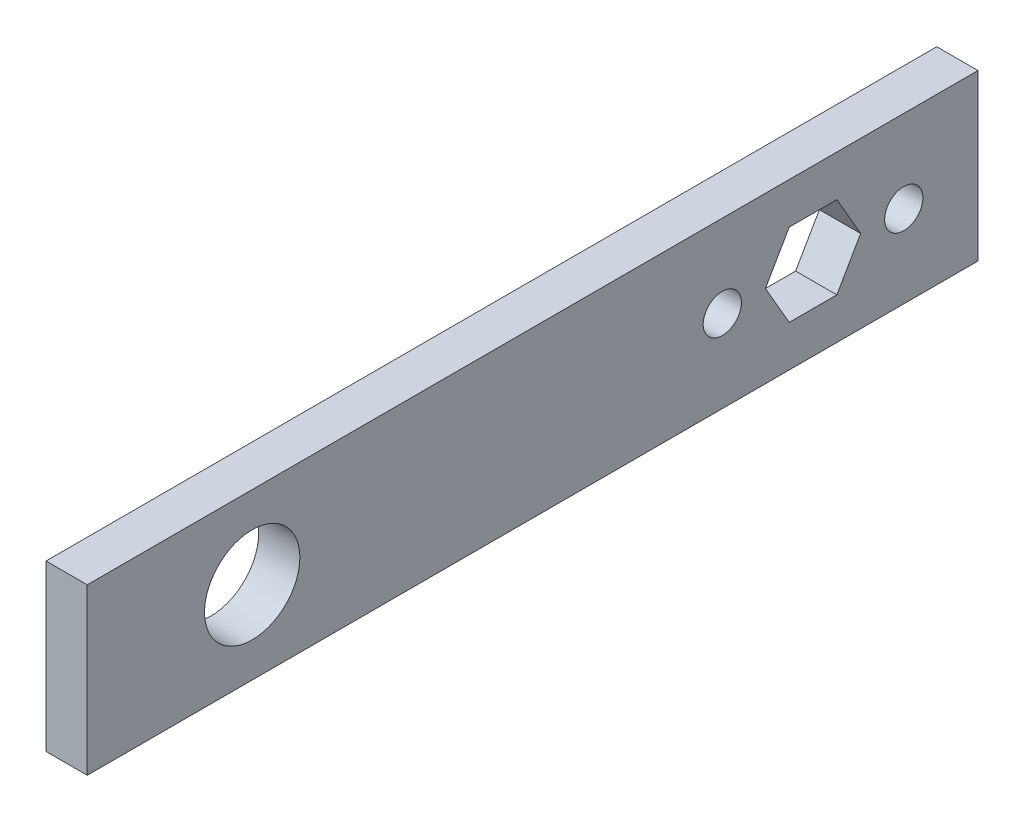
ISO-10303-21;
HEADER;
FILE_DESCRIPTION(('STEP AP214'),'2;1');
FILE_NAME('part.step','',(''),(''),'','','');
FILE_SCHEMA(('AUTOMOTIVE_DESIGN { 1 0 10303 214 1 1 1 1 }'));
ENDSEC;
DATA;
#1=APPLICATION_CONTEXT('core data for automotive mechanical design processes');
#2=APPLICATION_PROTOCOL_DEFINITION('international standard','automotive_design',2000,#1);
#3=PRODUCT_CONTEXT('',#1,'mechanical');
#4=PRODUCT('Part','Part','',(#3));
#5=PRODUCT_RELATED_PRODUCT_CATEGORY('part','',(#4));
#6=PRODUCT_DEFINITION_FORMATION('','',#4);
#7=PRODUCT_DEFINITION_CONTEXT('part definition',#1,'design');
#8=PRODUCT_DEFINITION('design','',#6,#7);
#9=PRODUCT_DEFINITION_SHAPE('','',#8);
#10=(LENGTH_UNIT() NAMED_UNIT(*) SI_UNIT(.MILLI.,.METRE.));
#11=(NAMED_UNIT(*) PLANE_ANGLE_UNIT() SI_UNIT($,.RADIAN.));
#12=(NAMED_UNIT(*) SI_UNIT($,.STERADIAN.) SOLID_ANGLE_UNIT());
#13=UNCERTAINTY_MEASURE_WITH_UNIT(LENGTH_MEASURE(1.E-05),#10,'distance_accuracy_value','');
#14=(GEOMETRIC_REPRESENTATION_CONTEXT(3) GLOBAL_UNCERTAINTY_ASSIGNED_CONTEXT((#13)) GLOBAL_UNIT_ASSIGNED_CONTEXT((#10,
#11,#12)) REPRESENTATION_CONTEXT('',''));
#15=CARTESIAN_POINT('',(0.,0.,0.));
#16=DIRECTION('',(0.,0.,1.));
#17=DIRECTION('',(1.,0.,0.));
#18=AXIS2_PLACEMENT_3D('',#15,#16,#17);
#19=CARTESIAN_POINT('',(0.,0.,0.));
#20=DIRECTION('',(-1.,0.,0.));
#21=DIRECTION('',(0.,0.,1.));
#22=AXIS2_PLACEMENT_3D('',#19,#20,#21);
#23=PLANE('',#22);
#24=DIRECTION('',(0.,0.866025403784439,-0.499999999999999));
#25=VECTOR('',#24,1.);
#26=CARTESIAN_POINT('',(0.,3.175,-57.7130871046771));
#27=LINE('',#26,#25);
#28=CARTESIAN_POINT('',(0.,3.175,-57.7130871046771));
#29=VERTEX_POINT('',#28);
#30=CARTESIAN_POINT('',(0.,6.35,-59.5461742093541));
#31=VERTEX_POINT('',#30);
#32=EDGE_CURVE('E114',#29,#31,#27,.T.);
#33=ORIENTED_EDGE('',*,*,#32,.T.);
#34=DIRECTION('',(0.,0.866025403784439,0.5));
#35=VECTOR('',#34,1.);
#36=CARTESIAN_POINT('',(0.,6.35,-59.5461742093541));
#37=LINE('',#36,#35);
#38=CARTESIAN_POINT('',(0.,9.52500000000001,-57.713087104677));
#39=VERTEX_POINT('',#38);
#40=EDGE_CURVE('E123',#31,#39,#37,.T.);
#41=ORIENTED_EDGE('',*,*,#40,.T.);
#42=DIRECTION('',(0.,0.,1.));
#43=VECTOR('',#42,1.);
#44=CARTESIAN_POINT('',(0.,9.52500000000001,-57.7130871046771));
#45=LINE('',#44,#43);
#46=CARTESIAN_POINT('',(0.,9.52500000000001,-54.0469128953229));
#47=VERTEX_POINT('',#46);
#48=EDGE_CURVE('E50',#39,#47,#45,.T.);
#49=ORIENTED_EDGE('',*,*,#48,.T.);
#50=DIRECTION('',(0.,-0.866025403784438,0.500000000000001));
#51=VECTOR('',#50,1.);
#52=CARTESIAN_POINT('',(0.,9.52500000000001,-54.0469128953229));
#53=LINE('',#52,#51);
#54=CARTESIAN_POINT('',(0.,6.35,-52.2138257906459));
#55=VERTEX_POINT('',#54);
#56=EDGE_CURVE('E137',#47,#55,#53,.T.);
#57=ORIENTED_EDGE('',*,*,#56,.T.);
#58=DIRECTION('',(0.,-0.866025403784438,-0.500000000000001));
#59=VECTOR('',#58,1.);
#60=CARTESIAN_POINT('',(0.,6.35,-52.2138257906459));
#61=LINE('',#60,#59);
#62=CARTESIAN_POINT('',(0.,3.175,-54.0469128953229));
#63=VERTEX_POINT('',#62);
#64=EDGE_CURVE('E140',#55,#63,#61,.T.);
#65=ORIENTED_EDGE('',*,*,#64,.T.);
#66=DIRECTION('',(0.,0.,-1.));
#67=VECTOR('',#66,1.);
#68=CARTESIAN_POINT('',(0.,3.175,-54.0469128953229));
#69=LINE('',#68,#67);
#70=EDGE_CURVE('E120',#63,#29,#69,.T.);
#71=ORIENTED_EDGE('',*,*,#70,.T.);
#72=EDGE_LOOP('',(#33,#41,#49,#57,#65,#71));
#73=FACE_BOUND('',#72,.T.);
#74=CARTESIAN_POINT('',(0.,6.35,-48.895));
#75=DIRECTION('',(1.,0.,0.));
#76=DIRECTION('',(0.,0.,-1.));
#77=AXIS2_PLACEMENT_3D('',#74,#75,#76);
#78=CIRCLE('',#77,1.4732);
#79=CARTESIAN_POINT('',(0.,6.35,-50.3682));
#80=VERTEX_POINT('',#79);
#81=EDGE_CURVE('E166',#80,#80,#78,.T.);
#82=ORIENTED_EDGE('',*,*,#81,.T.);
#83=EDGE_LOOP('',(#82));
#84=FACE_BOUND('',#83,.T.);
#85=CARTESIAN_POINT('',(0.,6.35,-12.7));
#86=DIRECTION('',(1.,0.,0.));
#87=DIRECTION('',(0.,0.,-1.));
#88=AXIS2_PLACEMENT_3D('',#85,#86,#87);
#89=CIRCLE('',#88,3.6703);
#90=CARTESIAN_POINT('',(0.,6.35,-16.3703));
#91=VERTEX_POINT('',#90);
#92=EDGE_CURVE('E175',#91,#91,#89,.T.);
#93=ORIENTED_EDGE('',*,*,#92,.T.);
#94=EDGE_LOOP('',(#93));
#95=FACE_BOUND('',#94,.T.);
#96=DIRECTION('',(0.,-1.,0.));
#97=VECTOR('',#96,1.);
#98=CARTESIAN_POINT('',(0.,0.,0.));
#99=LINE('',#98,#97);
#100=CARTESIAN_POINT('',(0.,12.7,0.));
#101=VERTEX_POINT('',#100);
#102=CARTESIAN_POINT('',(0.,0.,0.));
#103=VERTEX_POINT('',#102);
#104=EDGE_CURVE('E179',#101,#103,#99,.T.);
#105=ORIENTED_EDGE('',*,*,#104,.F.);
#106=DIRECTION('',(0.,0.,1.));
#107=VECTOR('',#106,1.);
#108=CARTESIAN_POINT('',(0.,12.7,0.));
#109=LINE('',#108,#107);
#110=CARTESIAN_POINT('',(0.,12.7,-68.58));
#111=VERTEX_POINT('',#110);
#112=EDGE_CURVE('E186',#111,#101,#109,.T.);
#113=ORIENTED_EDGE('',*,*,#112,.F.);
#114=DIRECTION('',(0.,1.,0.));
#115=VECTOR('',#114,1.);
#116=CARTESIAN_POINT('',(0.,0.,-68.58));
#117=LINE('',#116,#115);
#118=CARTESIAN_POINT('',(0.,0.,-68.58));
#119=VERTEX_POINT('',#118);
#120=EDGE_CURVE('E197',#119,#111,#117,.T.);
#121=ORIENTED_EDGE('',*,*,#120,.F.);
#122=DIRECTION('',(0.,0.,-1.));
#123=VECTOR('',#122,1.);
#124=CARTESIAN_POINT('',(0.,0.,0.));
#125=LINE('',#124,#123);
#126=EDGE_CURVE('E195',#103,#119,#125,.T.);
#127=ORIENTED_EDGE('',*,*,#126,.F.);
#128=EDGE_LOOP('',(#105,#113,#121,#127));
#129=FACE_BOUND('',#128,.T.);
#130=CARTESIAN_POINT('',(0.,6.35,-62.865));
#131=DIRECTION('',(1.,0.,0.));
#132=DIRECTION('',(0.,0.,-1.));
#133=AXIS2_PLACEMENT_3D('',#130,#131,#132);
#134=CIRCLE('',#133,1.4732);
#135=CARTESIAN_POINT('',(0.,6.35,-64.3382));
#136=VERTEX_POINT('',#135);
#137=EDGE_CURVE('E172',#136,#136,#134,.T.);
#138=ORIENTED_EDGE('',*,*,#137,.T.);
#139=EDGE_LOOP('',(#138));
#140=FACE_BOUND('',#139,.T.);
#141=ADVANCED_FACE('F35',(#73,#84,#95,#129,#140),#23,.T.);
#142=CARTESIAN_POINT('',(3.175,0.,0.));
#143=DIRECTION('',(-1.,0.,0.));
#144=DIRECTION('',(0.,0.,1.));
#145=AXIS2_PLACEMENT_3D('',#142,#143,#144);
#146=PLANE('',#145);
#147=DIRECTION('',(0.,0.866025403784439,0.5));
#148=VECTOR('',#147,1.);
#149=CARTESIAN_POINT('',(3.175,6.35,-59.5461742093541));
#150=LINE('',#149,#148);
#151=CARTESIAN_POINT('',(3.175,6.35000000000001,-59.5461742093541));
#152=VERTEX_POINT('',#151);
#153=CARTESIAN_POINT('',(3.175,9.52500000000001,-57.7130871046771));
#154=VERTEX_POINT('',#153);
#155=EDGE_CURVE('E144',#152,#154,#150,.T.);
#156=ORIENTED_EDGE('',*,*,#155,.F.);
#157=DIRECTION('',(0.,0.866025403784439,-0.499999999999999));
#158=VECTOR('',#157,1.);
#159=CARTESIAN_POINT('',(3.175,3.175,-57.7130871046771));
#160=LINE('',#159,#158);
#161=CARTESIAN_POINT('',(3.175,3.175,-57.7130871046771));
#162=VERTEX_POINT('',#161);
#163=EDGE_CURVE('E58',#162,#152,#160,.T.);
#164=ORIENTED_EDGE('',*,*,#163,.F.);
#165=DIRECTION('',(0.,0.,-1.));
#166=VECTOR('',#165,1.);
#167=CARTESIAN_POINT('',(3.175,3.175,-54.0469128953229));
#168=LINE('',#167,#166);
#169=CARTESIAN_POINT('',(3.175,3.175,-54.0469128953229));
#170=VERTEX_POINT('',#169);
#171=EDGE_CURVE('E130',#170,#162,#168,.T.);
#172=ORIENTED_EDGE('',*,*,#171,.F.);
#173=DIRECTION('',(0.,-0.866025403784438,-0.500000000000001));
#174=VECTOR('',#173,1.);
#175=CARTESIAN_POINT('',(3.175,6.35,-52.2138257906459));
#176=LINE('',#175,#174);
#177=CARTESIAN_POINT('',(3.175,6.35,-52.2138257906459));
#178=VERTEX_POINT('',#177);
#179=EDGE_CURVE('E133',#178,#170,#176,.T.);
#180=ORIENTED_EDGE('',*,*,#179,.F.);
#181=DIRECTION('',(0.,-0.866025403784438,0.500000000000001));
#182=VECTOR('',#181,1.);
#183=CARTESIAN_POINT('',(3.175,9.52500000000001,-54.0469128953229));
#184=LINE('',#183,#182);
#185=CARTESIAN_POINT('',(3.175,9.52500000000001,-54.0469128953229));
#186=VERTEX_POINT('',#185);
#187=EDGE_CURVE('E149',#186,#178,#184,.T.);
#188=ORIENTED_EDGE('',*,*,#187,.F.);
#189=DIRECTION('',(0.,0.,1.));
#190=VECTOR('',#189,1.);
#191=CARTESIAN_POINT('',(3.175,9.52500000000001,-57.7130871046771));
#192=LINE('',#191,#190);
#193=EDGE_CURVE('E146',#154,#186,#192,.T.);
#194=ORIENTED_EDGE('',*,*,#193,.F.);
#195=EDGE_LOOP('',(#156,#164,#172,#180,#188,#194));
#196=FACE_BOUND('',#195,.T.);
#197=CARTESIAN_POINT('',(3.175,6.35,-48.895));
#198=DIRECTION('',(1.,0.,0.));
#199=DIRECTION('',(0.,0.,-1.));
#200=AXIS2_PLACEMENT_3D('',#197,#198,#199);
#201=CIRCLE('',#200,1.47319999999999);
#202=CARTESIAN_POINT('',(3.175,6.35,-50.3682));
#203=VERTEX_POINT('',#202);
#204=EDGE_CURVE('E156',#203,#203,#201,.T.);
#205=ORIENTED_EDGE('',*,*,#204,.F.);
#206=EDGE_LOOP('',(#205));
#207=FACE_BOUND('',#206,.T.);
#208=CARTESIAN_POINT('',(3.175,6.35,-62.865));
#209=DIRECTION('',(1.,0.,0.));
#210=DIRECTION('',(0.,0.,-1.));
#211=AXIS2_PLACEMENT_3D('',#208,#209,#210);
#212=CIRCLE('',#211,1.47319999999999);
#213=CARTESIAN_POINT('',(3.175,6.35,-64.3382));
#214=VERTEX_POINT('',#213);
#215=EDGE_CURVE('E169',#214,#214,#212,.T.);
#216=ORIENTED_EDGE('',*,*,#215,.F.);
#217=EDGE_LOOP('',(#216));
#218=FACE_BOUND('',#217,.T.);
#219=DIRECTION('',(0.,-1.,0.));
#220=VECTOR('',#219,1.);
#221=CARTESIAN_POINT('',(3.175,0.,0.));
#222=LINE('',#221,#220);
#223=CARTESIAN_POINT('',(3.175,12.7,0.));
#224=VERTEX_POINT('',#223);
#225=CARTESIAN_POINT('',(3.175,0.,0.));
#226=VERTEX_POINT('',#225);
#227=EDGE_CURVE('E182',#224,#226,#222,.T.);
#228=ORIENTED_EDGE('',*,*,#227,.T.);
#229=DIRECTION('',(0.,0.,-1.));
#230=VECTOR('',#229,1.);
#231=CARTESIAN_POINT('',(3.175,0.,0.));
#232=LINE('',#231,#230);
#233=CARTESIAN_POINT('',(3.175,0.,-68.58));
#234=VERTEX_POINT('',#233);
#235=EDGE_CURVE('E185',#226,#234,#232,.T.);
#236=ORIENTED_EDGE('',*,*,#235,.T.);
#237=DIRECTION('',(0.,1.,0.));
#238=VECTOR('',#237,1.);
#239=CARTESIAN_POINT('',(3.175,0.,-68.58));
#240=LINE('',#239,#238);
#241=CARTESIAN_POINT('',(3.175,12.7,-68.58));
#242=VERTEX_POINT('',#241);
#243=EDGE_CURVE('E188',#234,#242,#240,.T.);
#244=ORIENTED_EDGE('',*,*,#243,.T.);
#245=DIRECTION('',(0.,0.,1.));
#246=VECTOR('',#245,1.);
#247=CARTESIAN_POINT('',(3.175,12.7,0.));
#248=LINE('',#247,#246);
#249=EDGE_CURVE('E190',#242,#224,#248,.T.);
#250=ORIENTED_EDGE('',*,*,#249,.T.);
#251=EDGE_LOOP('',(#228,#236,#244,#250));
#252=FACE_BOUND('',#251,.T.);
#253=CARTESIAN_POINT('',(3.175,6.35,-12.7));
#254=DIRECTION('',(1.,0.,0.));
#255=DIRECTION('',(0.,0.,-1.));
#256=AXIS2_PLACEMENT_3D('',#253,#254,#255);
#257=CIRCLE('',#256,3.6703);
#258=CARTESIAN_POINT('',(3.175,6.35,-16.3703));
#259=VERTEX_POINT('',#258);
#260=EDGE_CURVE('E176',#259,#259,#257,.T.);
#261=ORIENTED_EDGE('',*,*,#260,.F.);
#262=EDGE_LOOP('',(#261));
#263=FACE_BOUND('',#262,.T.);
#264=ADVANCED_FACE('F224',(#196,#207,#218,#252,#263),#146,.F.);
#265=CARTESIAN_POINT('',(3.175,0.,0.));
#266=DIRECTION('',(0.,0.,-1.));
#267=DIRECTION('',(-1.,0.,0.));
#268=AXIS2_PLACEMENT_3D('',#265,#266,#267);
#269=PLANE('',#268);
#270=ORIENTED_EDGE('',*,*,#104,.T.);
#271=DIRECTION('',(-1.,0.,0.));
#272=VECTOR('',#271,1.);
#273=CARTESIAN_POINT('',(3.175,0.,0.));
#274=LINE('',#273,#272);
#275=EDGE_CURVE('E11',#226,#103,#274,.T.);
#276=ORIENTED_EDGE('',*,*,#275,.F.);
#277=ORIENTED_EDGE('',*,*,#227,.F.);
#278=DIRECTION('',(-1.,0.,0.));
#279=VECTOR('',#278,1.);
#280=CARTESIAN_POINT('',(3.175,12.7,0.));
#281=LINE('',#280,#279);
#282=EDGE_CURVE('E192',#224,#101,#281,.T.);
#283=ORIENTED_EDGE('',*,*,#282,.T.);
#284=EDGE_LOOP('',(#270,#276,#277,#283));
#285=FACE_BOUND('',#284,.T.);
#286=ADVANCED_FACE('F37',(#285),#269,.F.);
#287=CARTESIAN_POINT('',(3.175,0.,0.));
#288=DIRECTION('',(0.,1.,0.));
#289=DIRECTION('',(0.,0.,1.));
#290=AXIS2_PLACEMENT_3D('',#287,#288,#289);
#291=PLANE('',#290);
#292=ORIENTED_EDGE('',*,*,#126,.T.);
#293=DIRECTION('',(-1.,0.,0.));
#294=VECTOR('',#293,1.);
#295=CARTESIAN_POINT('',(3.175,0.,-68.58));
#296=LINE('',#295,#294);
#297=EDGE_CURVE('E43',#234,#119,#296,.T.);
#298=ORIENTED_EDGE('',*,*,#297,.F.);
#299=ORIENTED_EDGE('',*,*,#235,.F.);
#300=ORIENTED_EDGE('',*,*,#275,.T.);
#301=EDGE_LOOP('',(#292,#298,#299,#300));
#302=FACE_BOUND('',#301,.T.);
#303=ADVANCED_FACE('F226',(#302),#291,.F.);
#304=CARTESIAN_POINT('',(3.175,0.,-68.58));
#305=DIRECTION('',(0.,0.,1.));
#306=DIRECTION('',(1.,0.,0.));
#307=AXIS2_PLACEMENT_3D('',#304,#305,#306);
#308=PLANE('',#307);
#309=ORIENTED_EDGE('',*,*,#120,.T.);
#310=DIRECTION('',(-1.,0.,0.));
#311=VECTOR('',#310,1.);
#312=CARTESIAN_POINT('',(3.175,12.7,-68.58));
#313=LINE('',#312,#311);
#314=EDGE_CURVE('E202',#242,#111,#313,.T.);
#315=ORIENTED_EDGE('',*,*,#314,.F.);
#316=ORIENTED_EDGE('',*,*,#243,.F.);
#317=ORIENTED_EDGE('',*,*,#297,.T.);
#318=EDGE_LOOP('',(#309,#315,#316,#317));
#319=FACE_BOUND('',#318,.T.);
#320=ADVANCED_FACE('F209',(#319),#308,.F.);
#321=CARTESIAN_POINT('',(3.175,12.7,0.));
#322=DIRECTION('',(0.,-1.,0.));
#323=DIRECTION('',(0.,0.,-1.));
#324=AXIS2_PLACEMENT_3D('',#321,#322,#323);
#325=PLANE('',#324);
#326=ORIENTED_EDGE('',*,*,#112,.T.);
#327=ORIENTED_EDGE('',*,*,#282,.F.);
#328=ORIENTED_EDGE('',*,*,#249,.F.);
#329=ORIENTED_EDGE('',*,*,#314,.T.);
#330=EDGE_LOOP('',(#326,#327,#328,#329));
#331=FACE_BOUND('',#330,.T.);
#332=ADVANCED_FACE('F218',(#331),#325,.F.);
#333=CARTESIAN_POINT('',(3.175,6.35,-12.7));
#334=DIRECTION('',(-1.,0.,0.));
#335=DIRECTION('',(0.,0.,1.));
#336=AXIS2_PLACEMENT_3D('',#333,#334,#335);
#337=CYLINDRICAL_SURFACE('',#336,3.6703);
#338=ORIENTED_EDGE('',*,*,#260,.T.);
#339=EDGE_LOOP('',(#338));
#340=FACE_BOUND('',#339,.T.);
#341=ORIENTED_EDGE('',*,*,#92,.F.);
#342=EDGE_LOOP('',(#341));
#343=FACE_BOUND('',#342,.T.);
#344=ADVANCED_FACE('F243',(#340,#343),#337,.F.);
#345=CARTESIAN_POINT('',(3.175,6.35,-62.865));
#346=DIRECTION('',(1.,0.,0.));
#347=DIRECTION('',(0.,0.,-1.));
#348=AXIS2_PLACEMENT_3D('',#345,#346,#347);
#349=CYLINDRICAL_SURFACE('',#348,1.47319999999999);
#350=ORIENTED_EDGE('',*,*,#137,.F.);
#351=EDGE_LOOP('',(#350));
#352=FACE_BOUND('',#351,.T.);
#353=ORIENTED_EDGE('',*,*,#215,.T.);
#354=EDGE_LOOP('',(#353));
#355=FACE_BOUND('',#354,.T.);
#356=ADVANCED_FACE('F247',(#352,#355),#349,.F.);
#357=CARTESIAN_POINT('',(3.175,6.35,-48.895));
#358=DIRECTION('',(1.,0.,0.));
#359=DIRECTION('',(0.,0.,-1.));
#360=AXIS2_PLACEMENT_3D('',#357,#358,#359);
#361=CYLINDRICAL_SURFACE('',#360,1.47319999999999);
#362=ORIENTED_EDGE('',*,*,#81,.F.);
#363=EDGE_LOOP('',(#362));
#364=FACE_BOUND('',#363,.T.);
#365=ORIENTED_EDGE('',*,*,#204,.T.);
#366=EDGE_LOOP('',(#365));
#367=FACE_BOUND('',#366,.T.);
#368=ADVANCED_FACE('F252',(#364,#367),#361,.F.);
#369=CARTESIAN_POINT('',(0.,3.175,-57.7130871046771));
#370=DIRECTION('',(0.,-0.499999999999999,-0.866025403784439));
#371=DIRECTION('',(0.,0.866025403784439,-0.499999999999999));
#372=AXIS2_PLACEMENT_3D('',#369,#370,#371);
#373=PLANE('',#372);
#374=ORIENTED_EDGE('',*,*,#163,.T.);
#375=DIRECTION('',(1.,0.,0.));
#376=VECTOR('',#375,1.);
#377=CARTESIAN_POINT('',(0.,6.35,-59.5461742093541));
#378=LINE('',#377,#376);
#379=EDGE_CURVE('E110',#31,#152,#378,.T.);
#380=ORIENTED_EDGE('',*,*,#379,.F.);
#381=ORIENTED_EDGE('',*,*,#32,.F.);
#382=DIRECTION('',(1.,0.,0.));
#383=VECTOR('',#382,1.);
#384=CARTESIAN_POINT('',(0.,3.175,-57.7130871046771));
#385=LINE('',#384,#383);
#386=EDGE_CURVE('E154',#29,#162,#385,.T.);
#387=ORIENTED_EDGE('',*,*,#386,.T.);
#388=EDGE_LOOP('',(#374,#380,#381,#387));
#389=FACE_BOUND('',#388,.T.);
#390=ADVANCED_FACE('F112',(#389),#373,.F.);
#391=CARTESIAN_POINT('',(0.,3.175,-54.0469128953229));
#392=DIRECTION('',(0.,-1.,0.));
#393=DIRECTION('',(0.,0.,-1.));
#394=AXIS2_PLACEMENT_3D('',#391,#392,#393);
#395=PLANE('',#394);
#396=ORIENTED_EDGE('',*,*,#171,.T.);
#397=ORIENTED_EDGE('',*,*,#386,.F.);
#398=ORIENTED_EDGE('',*,*,#70,.F.);
#399=DIRECTION('',(1.,0.,0.));
#400=VECTOR('',#399,1.);
#401=CARTESIAN_POINT('',(0.,3.175,-54.0469128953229));
#402=LINE('',#401,#400);
#403=EDGE_CURVE('E157',#63,#170,#402,.T.);
#404=ORIENTED_EDGE('',*,*,#403,.T.);
#405=EDGE_LOOP('',(#396,#397,#398,#404));
#406=FACE_BOUND('',#405,.T.);
#407=ADVANCED_FACE('F262',(#406),#395,.F.);
#408=CARTESIAN_POINT('',(0.,6.35,-52.2138257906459));
#409=DIRECTION('',(0.,-0.500000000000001,0.866025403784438));
#410=DIRECTION('',(0.,-0.866025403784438,-0.500000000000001));
#411=AXIS2_PLACEMENT_3D('',#408,#409,#410);
#412=PLANE('',#411);
#413=ORIENTED_EDGE('',*,*,#179,.T.);
#414=ORIENTED_EDGE('',*,*,#403,.F.);
#415=ORIENTED_EDGE('',*,*,#64,.F.);
#416=DIRECTION('',(1.,0.,0.));
#417=VECTOR('',#416,1.);
#418=CARTESIAN_POINT('',(0.,6.35,-52.2138257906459));
#419=LINE('',#418,#417);
#420=EDGE_CURVE('E159',#55,#178,#419,.T.);
#421=ORIENTED_EDGE('',*,*,#420,.T.);
#422=EDGE_LOOP('',(#413,#414,#415,#421));
#423=FACE_BOUND('',#422,.T.);
#424=ADVANCED_FACE('F271',(#423),#412,.F.);
#425=CARTESIAN_POINT('',(0.,9.52500000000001,-54.0469128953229));
#426=DIRECTION('',(0.,0.500000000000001,0.866025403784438));
#427=DIRECTION('',(0.,-0.866025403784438,0.500000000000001));
#428=AXIS2_PLACEMENT_3D('',#425,#426,#427);
#429=PLANE('',#428);
#430=ORIENTED_EDGE('',*,*,#187,.T.);
#431=ORIENTED_EDGE('',*,*,#420,.F.);
#432=ORIENTED_EDGE('',*,*,#56,.F.);
#433=DIRECTION('',(1.,0.,0.));
#434=VECTOR('',#433,1.);
#435=CARTESIAN_POINT('',(0.,9.52500000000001,-54.0469128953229));
#436=LINE('',#435,#434);
#437=EDGE_CURVE('E161',#47,#186,#436,.T.);
#438=ORIENTED_EDGE('',*,*,#437,.T.);
#439=EDGE_LOOP('',(#430,#431,#432,#438));
#440=FACE_BOUND('',#439,.T.);
#441=ADVANCED_FACE('F268',(#440),#429,.F.);
#442=CARTESIAN_POINT('',(0.,9.52500000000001,-57.7130871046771));
#443=DIRECTION('',(0.,1.,0.));
#444=DIRECTION('',(0.,0.,1.));
#445=AXIS2_PLACEMENT_3D('',#442,#443,#444);
#446=PLANE('',#445);
#447=ORIENTED_EDGE('',*,*,#193,.T.);
#448=ORIENTED_EDGE('',*,*,#437,.F.);
#449=ORIENTED_EDGE('',*,*,#48,.F.);
#450=DIRECTION('',(1.,0.,0.));
#451=VECTOR('',#450,1.);
#452=CARTESIAN_POINT('',(0.,9.52500000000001,-57.7130871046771));
#453=LINE('',#452,#451);
#454=EDGE_CURVE('E119',#39,#154,#453,.T.);
#455=ORIENTED_EDGE('',*,*,#454,.T.);
#456=EDGE_LOOP('',(#447,#448,#449,#455));
#457=FACE_BOUND('',#456,.T.);
#458=ADVANCED_FACE('F265',(#457),#446,.F.);
#459=CARTESIAN_POINT('',(0.,6.35,-59.5461742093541));
#460=DIRECTION('',(0.,0.5,-0.866025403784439));
#461=DIRECTION('',(0.,0.866025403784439,0.5));
#462=AXIS2_PLACEMENT_3D('',#459,#460,#461);
#463=PLANE('',#462);
#464=ORIENTED_EDGE('',*,*,#155,.T.);
#465=ORIENTED_EDGE('',*,*,#454,.F.);
#466=ORIENTED_EDGE('',*,*,#40,.F.);
#467=ORIENTED_EDGE('',*,*,#379,.T.);
#468=EDGE_LOOP('',(#464,#465,#466,#467));
#469=FACE_BOUND('',#468,.T.);
#470=ADVANCED_FACE('F124',(#469),#463,.F.);
#471=CLOSED_SHELL('',(#141,#264,#286,#303,#320,#332,#344,#356,#368,#390,#407,#424,#441,#458,#470));
#472=MANIFOLD_SOLID_BREP('B2',#471);
#473=ADVANCED_BREP_SHAPE_REPRESENTATION('',(#18,#472),#14);
#474=SHAPE_DEFINITION_REPRESENTATION(#9,#473);
ENDSEC;
END-ISO-10303-21;
